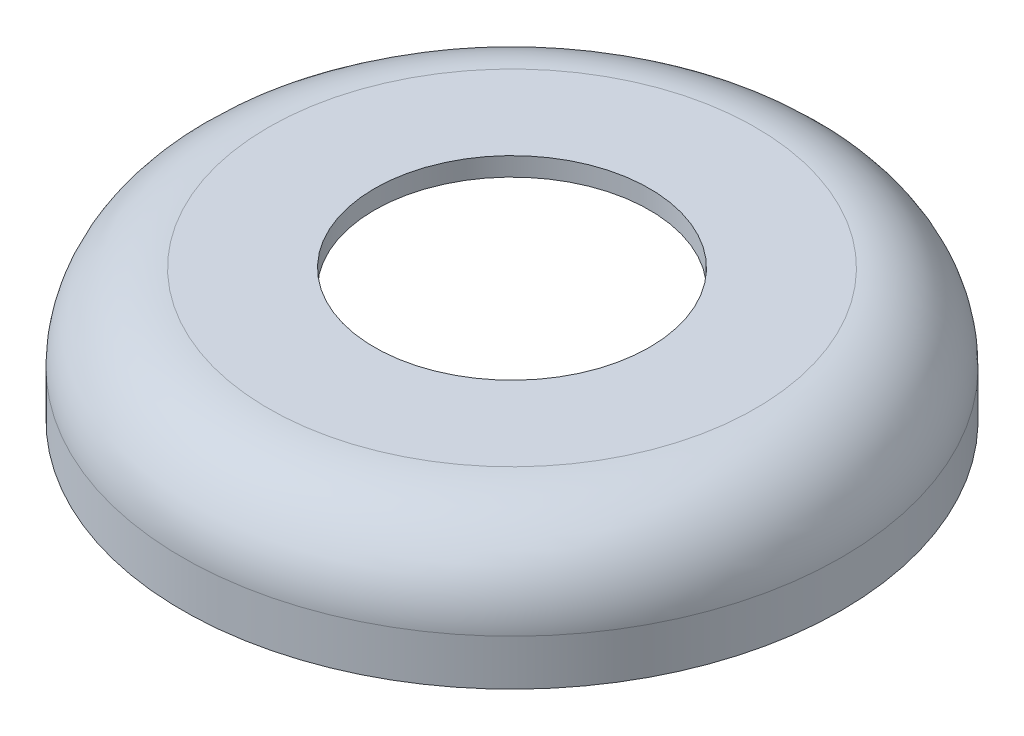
from build123d import *

# Parameters (mm, degrees)
SHELL1_T           = -0.65
CUT_EXTRUDE1_REACH = 18.901
SKETCH2_R          = 4.8


with BuildPart() as part:
    # Sketch1 → Revolve1 (revolve)
    with BuildSketch(Plane.XY, mode=Mode.PRIVATE) as revolve1_sk:
        with BuildLine():
            Line((0, 0), (8.5, 0))
            ThreePointArc((8.5, 0), (10.621320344, -0.878679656), (11.5, -3))
            Line((11.5, -3), (11.5, -4.6))
            Line((11.5, -4.6), (0, -4.6))
            Line((0, -4.6), (0, 0))
        make_face()
    revolve(revolve1_sk.sketch.rotate(Axis((0, 0, 0), (0, -1, 0)), 180), axis=Axis((0, 0, 0), (0, -1, 0)))

    # Shell1
    shell1_openings = [part.faces().sort_by_distance(p)[0] for p in [
        (0, -4.6, 0),
    ]]
    offset(amount=SHELL1_T, openings=shell1_openings, kind=Kind.INTERSECTION)

    # Sketch2 → Cut-Extrude1 (cut, up to next)
    with BuildSketch(Plane(origin=(0, 0, 0), x_dir=(1, 0, 0), z_dir=(0, 1, 0)), mode=Mode.PRIVATE) as cut_extrude1_sk1:
        with Locations(Location((0, 0, 0), (0, 0, 180))):
            Circle(SKETCH2_R)
    cut_extrude1_tool1 = extrude(cut_extrude1_sk1.sketch, amount=-CUT_EXTRUDE1_REACH, mode=Mode.PRIVATE) & part.part
    add(cut_extrude1_tool1.solids().sort_by_distance((0, 0, 0))[0], mode=Mode.SUBTRACT)


solid = part.part
